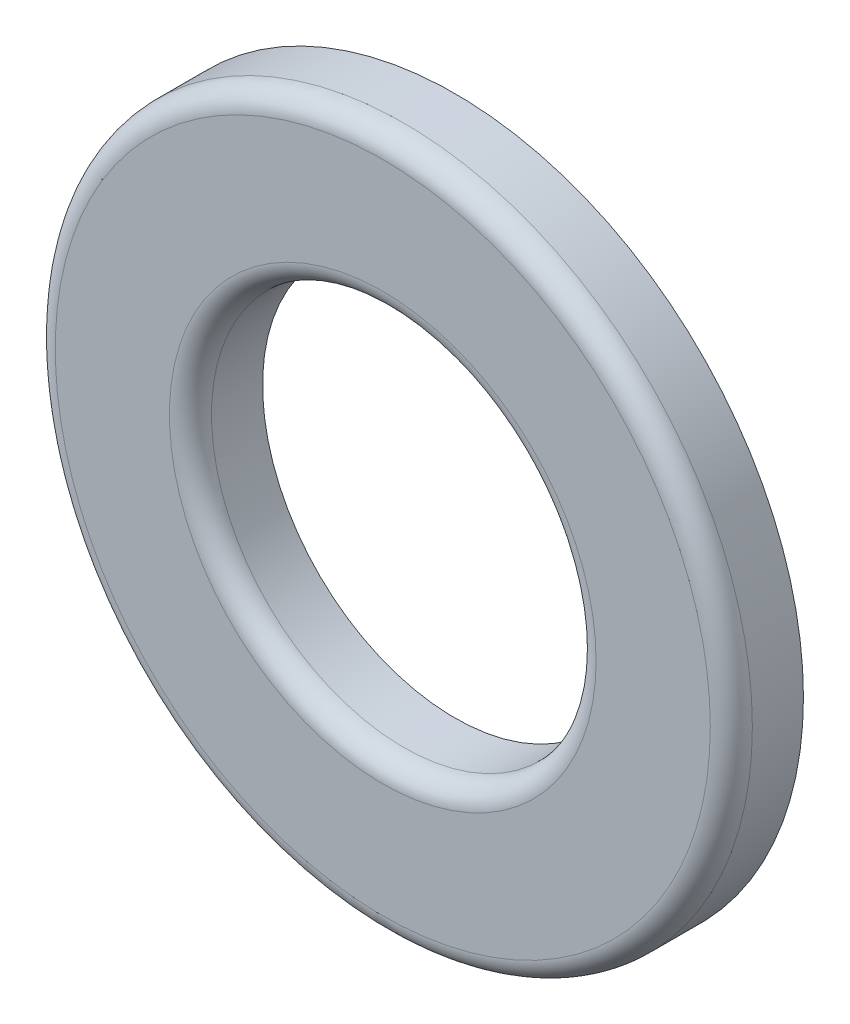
from build123d import *

# Parameters (mm, degrees)
ESQUISSE1_R          = 5.8
ESQUISSE1_R_2        = 3.2
BASE_EXTRUSION_DEPTH = 1.2
CONG_1_R             = 0.35


with BuildPart() as part:
    # Esquisse1 → Base-Extrusion (new body)
    with BuildSketch(Plane.XY):
        Circle(ESQUISSE1_R)
        Circle(ESQUISSE1_R_2, mode=Mode.SUBTRACT)
    extrude(amount=BASE_EXTRUSION_DEPTH)

    # Cong_1
    cong_1_edges = [part.edges().sort_by_distance(p)[0] for p in [
        (-5.8, 0, 1.2),
        (-3.2, 0, 1.2),
    ]]
    fillet(cong_1_edges, radius=CONG_1_R)


solid = part.part
